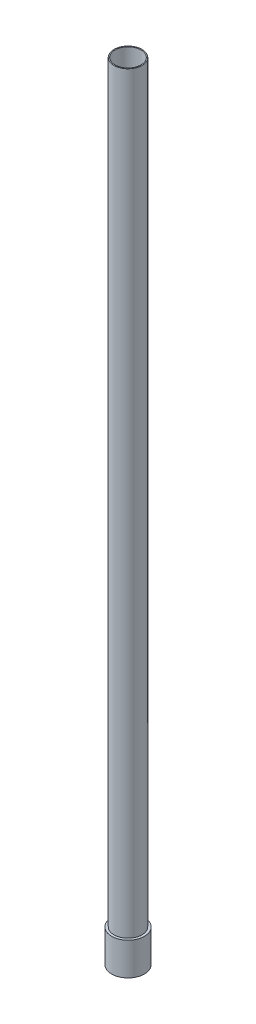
ISO-10303-21;
HEADER;
FILE_DESCRIPTION(('STEP AP214'),'2;1');
FILE_NAME('part.step','',(''),(''),'','','');
FILE_SCHEMA(('AUTOMOTIVE_DESIGN { 1 0 10303 214 1 1 1 1 }'));
ENDSEC;
DATA;
#1=APPLICATION_CONTEXT('core data for automotive mechanical design processes');
#2=APPLICATION_PROTOCOL_DEFINITION('international standard','automotive_design',2000,#1);
#3=PRODUCT_CONTEXT('',#1,'mechanical');
#4=PRODUCT('Part','Part','',(#3));
#5=PRODUCT_RELATED_PRODUCT_CATEGORY('part','',(#4));
#6=PRODUCT_DEFINITION_FORMATION('','',#4);
#7=PRODUCT_DEFINITION_CONTEXT('part definition',#1,'design');
#8=PRODUCT_DEFINITION('design','',#6,#7);
#9=PRODUCT_DEFINITION_SHAPE('','',#8);
#10=(LENGTH_UNIT() NAMED_UNIT(*) SI_UNIT(.MILLI.,.METRE.));
#11=(NAMED_UNIT(*) PLANE_ANGLE_UNIT() SI_UNIT($,.RADIAN.));
#12=(NAMED_UNIT(*) SI_UNIT($,.STERADIAN.) SOLID_ANGLE_UNIT());
#13=UNCERTAINTY_MEASURE_WITH_UNIT(LENGTH_MEASURE(1.E-05),#10,'distance_accuracy_value','');
#14=(GEOMETRIC_REPRESENTATION_CONTEXT(3) GLOBAL_UNCERTAINTY_ASSIGNED_CONTEXT((#13)) GLOBAL_UNIT_ASSIGNED_CONTEXT((#10,
#11,#12)) REPRESENTATION_CONTEXT('',''));
#15=CARTESIAN_POINT('',(0.,0.,0.));
#16=DIRECTION('',(0.,0.,1.));
#17=DIRECTION('',(1.,0.,0.));
#18=AXIS2_PLACEMENT_3D('',#15,#16,#17);
#19=CARTESIAN_POINT('',(0.,0.,0.));
#20=DIRECTION('',(0.,-1.,0.));
#21=DIRECTION('',(0.,0.,-1.));
#22=AXIS2_PLACEMENT_3D('',#19,#20,#21);
#23=CYLINDRICAL_SURFACE('',#22,5.0419);
#24=CARTESIAN_POINT('',(0.,304.8,0.));
#25=DIRECTION('',(0.,-1.,0.));
#26=DIRECTION('',(0.,0.,-1.));
#27=AXIS2_PLACEMENT_3D('',#24,#25,#26);
#28=CIRCLE('',#27,5.0419);
#29=CARTESIAN_POINT('',(0.,304.8,-5.0419));
#30=VERTEX_POINT('',#29);
#31=EDGE_CURVE('E54',#30,#30,#28,.T.);
#32=ORIENTED_EDGE('',*,*,#31,.F.);
#33=EDGE_LOOP('',(#32));
#34=FACE_BOUND('',#33,.T.);
#35=CARTESIAN_POINT('',(0.,0.,0.));
#36=DIRECTION('',(0.,-1.,0.));
#37=DIRECTION('',(0.,0.,-1.));
#38=AXIS2_PLACEMENT_3D('',#35,#36,#37);
#39=CIRCLE('',#38,5.0419);
#40=CARTESIAN_POINT('',(0.,0.,-5.0419));
#41=VERTEX_POINT('',#40);
#42=EDGE_CURVE('E10',#41,#41,#39,.T.);
#43=ORIENTED_EDGE('',*,*,#42,.T.);
#44=EDGE_LOOP('',(#43));
#45=FACE_BOUND('',#44,.T.);
#46=ADVANCED_FACE('F32',(#34,#45),#23,.F.);
#47=CARTESIAN_POINT('',(-5.0419,0.,0.));
#48=DIRECTION('',(0.,1.,0.));
#49=DIRECTION('',(0.,0.,1.));
#50=AXIS2_PLACEMENT_3D('',#47,#48,#49);
#51=PLANE('',#50);
#52=ORIENTED_EDGE('',*,*,#42,.F.);
#53=EDGE_LOOP('',(#52));
#54=FACE_BOUND('',#53,.T.);
#55=CARTESIAN_POINT('',(0.,0.,0.));
#56=DIRECTION('',(0.,-1.,0.));
#57=DIRECTION('',(0.,0.,-1.));
#58=AXIS2_PLACEMENT_3D('',#55,#56,#57);
#59=CIRCLE('',#58,6.35);
#60=CARTESIAN_POINT('',(0.,0.,-6.35));
#61=VERTEX_POINT('',#60);
#62=EDGE_CURVE('E38',#61,#61,#59,.T.);
#63=ORIENTED_EDGE('',*,*,#62,.T.);
#64=EDGE_LOOP('',(#63));
#65=FACE_BOUND('',#64,.T.);
#66=ADVANCED_FACE('F61',(#54,#65),#51,.F.);
#67=CARTESIAN_POINT('',(0.,0.,0.));
#68=DIRECTION('',(0.,-1.,0.));
#69=DIRECTION('',(0.,0.,-1.));
#70=AXIS2_PLACEMENT_3D('',#67,#68,#69);
#71=CYLINDRICAL_SURFACE('',#70,6.35);
#72=ORIENTED_EDGE('',*,*,#62,.F.);
#73=EDGE_LOOP('',(#72));
#74=FACE_BOUND('',#73,.T.);
#75=CARTESIAN_POINT('',(0.,12.7,0.));
#76=DIRECTION('',(0.,-1.,0.));
#77=DIRECTION('',(0.,0.,-1.));
#78=AXIS2_PLACEMENT_3D('',#75,#76,#77);
#79=CIRCLE('',#78,6.35);
#80=CARTESIAN_POINT('',(0.,12.7,-6.35));
#81=VERTEX_POINT('',#80);
#82=EDGE_CURVE('E42',#81,#81,#79,.T.);
#83=ORIENTED_EDGE('',*,*,#82,.T.);
#84=EDGE_LOOP('',(#83));
#85=FACE_BOUND('',#84,.T.);
#86=ADVANCED_FACE('F65',(#74,#85),#71,.T.);
#87=CARTESIAN_POINT('',(-6.35,12.7,0.));
#88=DIRECTION('',(0.,-1.,0.));
#89=DIRECTION('',(0.,0.,-1.));
#90=AXIS2_PLACEMENT_3D('',#87,#88,#89);
#91=PLANE('',#90);
#92=ORIENTED_EDGE('',*,*,#82,.F.);
#93=EDGE_LOOP('',(#92));
#94=FACE_BOUND('',#93,.T.);
#95=CARTESIAN_POINT('',(0.,12.7,0.));
#96=DIRECTION('',(0.,-1.,0.));
#97=DIRECTION('',(0.,0.,-1.));
#98=AXIS2_PLACEMENT_3D('',#95,#96,#97);
#99=CIRCLE('',#98,5.4229);
#100=CARTESIAN_POINT('',(0.,12.7,-5.4229));
#101=VERTEX_POINT('',#100);
#102=EDGE_CURVE('E46',#101,#101,#99,.T.);
#103=ORIENTED_EDGE('',*,*,#102,.T.);
#104=EDGE_LOOP('',(#103));
#105=FACE_BOUND('',#104,.T.);
#106=ADVANCED_FACE('F70',(#94,#105),#91,.F.);
#107=CARTESIAN_POINT('',(0.,0.,0.));
#108=DIRECTION('',(0.,-1.,0.));
#109=DIRECTION('',(0.,0.,-1.));
#110=AXIS2_PLACEMENT_3D('',#107,#108,#109);
#111=CYLINDRICAL_SURFACE('',#110,5.4229);
#112=ORIENTED_EDGE('',*,*,#102,.F.);
#113=EDGE_LOOP('',(#112));
#114=FACE_BOUND('',#113,.T.);
#115=CARTESIAN_POINT('',(0.,304.8,0.));
#116=DIRECTION('',(0.,-1.,0.));
#117=DIRECTION('',(0.,0.,-1.));
#118=AXIS2_PLACEMENT_3D('',#115,#116,#117);
#119=CIRCLE('',#118,5.4229);
#120=CARTESIAN_POINT('',(0.,304.8,-5.4229));
#121=VERTEX_POINT('',#120);
#122=EDGE_CURVE('E51',#121,#121,#119,.T.);
#123=ORIENTED_EDGE('',*,*,#122,.T.);
#124=EDGE_LOOP('',(#123));
#125=FACE_BOUND('',#124,.T.);
#126=ADVANCED_FACE('F76',(#114,#125),#111,.T.);
#127=CARTESIAN_POINT('',(-5.4229,304.8,0.));
#128=DIRECTION('',(0.,-1.,0.));
#129=DIRECTION('',(0.,0.,-1.));
#130=AXIS2_PLACEMENT_3D('',#127,#128,#129);
#131=PLANE('',#130);
#132=ORIENTED_EDGE('',*,*,#122,.F.);
#133=EDGE_LOOP('',(#132));
#134=FACE_BOUND('',#133,.T.);
#135=ORIENTED_EDGE('',*,*,#31,.T.);
#136=EDGE_LOOP('',(#135));
#137=FACE_BOUND('',#136,.T.);
#138=ADVANCED_FACE('F58',(#134,#137),#131,.F.);
#139=CLOSED_SHELL('',(#46,#66,#86,#106,#126,#138));
#140=MANIFOLD_SOLID_BREP('B2',#139);
#141=ADVANCED_BREP_SHAPE_REPRESENTATION('',(#18,#140),#14);
#142=SHAPE_DEFINITION_REPRESENTATION(#9,#141);
ENDSEC;
END-ISO-10303-21;
